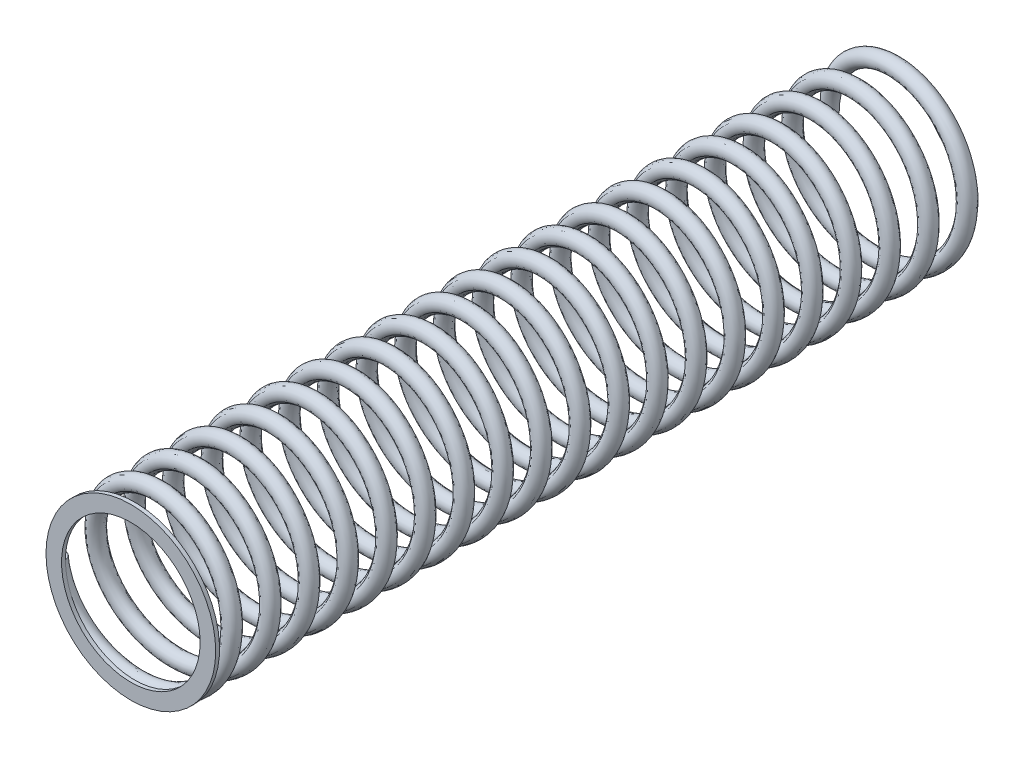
from build123d import *

# Parameters (mm, degrees)
SWEEP1_PITCH        = 10
SWEEP1_HEIGHT       = 200
SWEEP1_RADIUS       = 20
SWEEP1_START_ANGLE  = -180
SKETCH6_R           = 2
SKETCH7_W           = 44.812336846
SKETCH7_H           = 4.546005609
CUT_EXTRUDE1_DEPTH  = 70
SKETCH8_W           = 54.553357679
SKETCH8_H           = 16.35625819
CUT_EXTRUDE2_DEPTH  = 92
SKETCH9_R           = 21.921178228
SKETCH9_R_2         = 17.902347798
BOSS_EXTRUDE1_DEPTH = 1


with BuildPart() as part:
    # Sweep1: sweep along a helix
    with BuildLine() as sweep1_path:
        add(Helix(SWEEP1_PITCH, SWEEP1_HEIGHT, SWEEP1_RADIUS, center=(0, 0, 0), direction=(0, 0, 1), lefthand=True, mode=Mode.PRIVATE).rotate(Axis((0, 0, 0), (0, 0, 1)), SWEEP1_START_ANGLE))
    # Sketch6 → Sweep1 (sweep)
    with BuildSketch(Plane(origin=(0, 0, 0), x_dir=(1, 0, 0), z_dir=(0, 1, 0))):
        with Locations((-20, 0)):
            Circle(SKETCH6_R)
    sweep(path=sweep1_path.line, is_frenet=True)

    # Sketch7 → Cut-Extrude1 (cut)
    with BuildSketch(Plane(origin=(0, 0, 0), x_dir=(1, 0, 0), z_dir=(0, 1, 0))):
        with Locations((-0.605616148, -202.273002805)):
            Rectangle(SKETCH7_W, SKETCH7_H)
    extrude(amount=-CUT_EXTRUDE1_DEPTH, mode=Mode.SUBTRACT)

    # Sketch8 → Cut-Extrude2 (cut)
    with BuildSketch(Plane(origin=(0, 0, 0), x_dir=(1, 0, 0), z_dir=(0, 1, 0))):
        with Locations((5.27667884, 8.178129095)):
            Rectangle(SKETCH8_W, SKETCH8_H)
    extrude(amount=CUT_EXTRUDE2_DEPTH, mode=Mode.SUBTRACT)

    # Sketch9 → Boss-Extrude1 (add)
    with BuildSketch(Plane.XY.offset(200)):
        with Locations(Location((0, 0, 0), (0, 0, 180))):
            Circle(SKETCH9_R)
        Circle(SKETCH9_R_2, mode=Mode.SUBTRACT)
    extrude(amount=BOSS_EXTRUDE1_DEPTH)


solid = part.part
